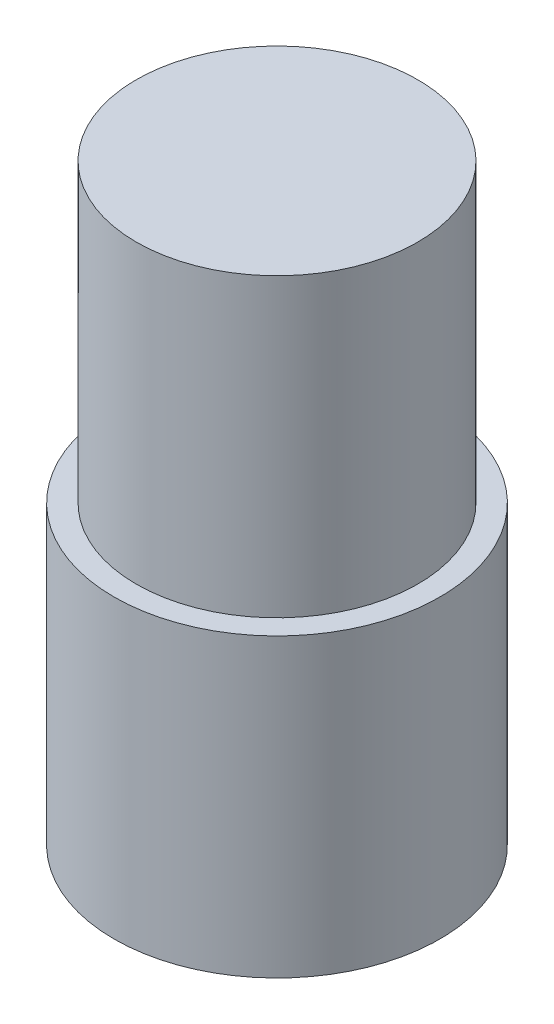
ISO-10303-21;
HEADER;
FILE_DESCRIPTION(('STEP AP214'),'2;1');
FILE_NAME('part.step','',(''),(''),'','','');
FILE_SCHEMA(('AUTOMOTIVE_DESIGN { 1 0 10303 214 1 1 1 1 }'));
ENDSEC;
DATA;
#1=APPLICATION_CONTEXT('core data for automotive mechanical design processes');
#2=APPLICATION_PROTOCOL_DEFINITION('international standard','automotive_design',2000,#1);
#3=PRODUCT_CONTEXT('',#1,'mechanical');
#4=PRODUCT('Part','Part','',(#3));
#5=PRODUCT_RELATED_PRODUCT_CATEGORY('part','',(#4));
#6=PRODUCT_DEFINITION_FORMATION('','',#4);
#7=PRODUCT_DEFINITION_CONTEXT('part definition',#1,'design');
#8=PRODUCT_DEFINITION('design','',#6,#7);
#9=PRODUCT_DEFINITION_SHAPE('','',#8);
#10=(LENGTH_UNIT() NAMED_UNIT(*) SI_UNIT(.MILLI.,.METRE.));
#11=(NAMED_UNIT(*) PLANE_ANGLE_UNIT() SI_UNIT($,.RADIAN.));
#12=(NAMED_UNIT(*) SI_UNIT($,.STERADIAN.) SOLID_ANGLE_UNIT());
#13=UNCERTAINTY_MEASURE_WITH_UNIT(LENGTH_MEASURE(1.E-05),#10,'distance_accuracy_value','');
#14=(GEOMETRIC_REPRESENTATION_CONTEXT(3) GLOBAL_UNCERTAINTY_ASSIGNED_CONTEXT((#13)) GLOBAL_UNIT_ASSIGNED_CONTEXT((#10,
#11,#12)) REPRESENTATION_CONTEXT('',''));
#15=CARTESIAN_POINT('',(0.,0.,0.));
#16=DIRECTION('',(0.,0.,1.));
#17=DIRECTION('',(1.,0.,0.));
#18=AXIS2_PLACEMENT_3D('',#15,#16,#17);
#19=CARTESIAN_POINT('',(0.,5.08,0.));
#20=DIRECTION('',(0.,-1.,0.));
#21=DIRECTION('',(0.,0.,-1.));
#22=AXIS2_PLACEMENT_3D('',#19,#20,#21);
#23=CYLINDRICAL_SURFACE('',#22,1.2065);
#24=CARTESIAN_POINT('',(0.,2.54,0.));
#25=DIRECTION('',(0.,1.,0.));
#26=DIRECTION('',(0.,0.,1.));
#27=AXIS2_PLACEMENT_3D('',#24,#25,#26);
#28=CIRCLE('',#27,1.2065);
#29=CARTESIAN_POINT('',(0.,2.54,1.2065));
#30=VERTEX_POINT('',#29);
#31=EDGE_CURVE('E38',#30,#30,#28,.T.);
#32=ORIENTED_EDGE('',*,*,#31,.T.);
#33=EDGE_LOOP('',(#32));
#34=FACE_BOUND('',#33,.T.);
#35=CARTESIAN_POINT('',(0.,5.08,0.));
#36=DIRECTION('',(0.,1.,0.));
#37=DIRECTION('',(0.,0.,1.));
#38=AXIS2_PLACEMENT_3D('',#35,#36,#37);
#39=CIRCLE('',#38,1.2065);
#40=CARTESIAN_POINT('',(0.,5.08,1.2065));
#41=VERTEX_POINT('',#40);
#42=EDGE_CURVE('E11',#41,#41,#39,.T.);
#43=ORIENTED_EDGE('',*,*,#42,.F.);
#44=EDGE_LOOP('',(#43));
#45=FACE_BOUND('',#44,.T.);
#46=ADVANCED_FACE('F35',(#34,#45),#23,.T.);
#47=CARTESIAN_POINT('',(0.,5.08,0.));
#48=DIRECTION('',(0.,1.,0.));
#49=DIRECTION('',(0.,0.,1.));
#50=AXIS2_PLACEMENT_3D('',#47,#48,#49);
#51=PLANE('',#50);
#52=ORIENTED_EDGE('',*,*,#42,.T.);
#53=EDGE_LOOP('',(#52));
#54=FACE_BOUND('',#53,.T.);
#55=ADVANCED_FACE('F64',(#54),#51,.T.);
#56=CARTESIAN_POINT('',(0.,2.54,0.));
#57=DIRECTION('',(0.,1.,0.));
#58=DIRECTION('',(0.,0.,1.));
#59=AXIS2_PLACEMENT_3D('',#56,#57,#58);
#60=PLANE('',#59);
#61=CARTESIAN_POINT('',(0.,2.54,0.));
#62=DIRECTION('',(0.,1.,0.));
#63=DIRECTION('',(0.,0.,1.));
#64=AXIS2_PLACEMENT_3D('',#61,#62,#63);
#65=CIRCLE('',#64,1.397);
#66=CARTESIAN_POINT('',(0.,2.54,1.397));
#67=VERTEX_POINT('',#66);
#68=EDGE_CURVE('E45',#67,#67,#65,.F.);
#69=ORIENTED_EDGE('',*,*,#68,.F.);
#70=EDGE_LOOP('',(#69));
#71=FACE_BOUND('',#70,.T.);
#72=ORIENTED_EDGE('',*,*,#31,.F.);
#73=EDGE_LOOP('',(#72));
#74=FACE_BOUND('',#73,.T.);
#75=ADVANCED_FACE('F58',(#71,#74),#60,.T.);
#76=CARTESIAN_POINT('',(0.,9.03131269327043,0.));
#77=DIRECTION('',(0.,-1.,0.));
#78=DIRECTION('',(0.,0.,-1.));
#79=AXIS2_PLACEMENT_3D('',#76,#77,#78);
#80=CYLINDRICAL_SURFACE('',#79,1.397);
#81=CARTESIAN_POINT('',(0.,0.,0.));
#82=DIRECTION('',(0.,-1.,0.));
#83=DIRECTION('',(0.,0.,-1.));
#84=AXIS2_PLACEMENT_3D('',#81,#82,#83);
#85=CIRCLE('',#84,1.397);
#86=CARTESIAN_POINT('',(0.,0.,-1.397));
#87=VERTEX_POINT('',#86);
#88=EDGE_CURVE('E49',#87,#87,#85,.T.);
#89=ORIENTED_EDGE('',*,*,#88,.F.);
#90=EDGE_LOOP('',(#89));
#91=FACE_BOUND('',#90,.T.);
#92=ORIENTED_EDGE('',*,*,#68,.T.);
#93=EDGE_LOOP('',(#92));
#94=FACE_BOUND('',#93,.T.);
#95=ADVANCED_FACE('F55',(#91,#94),#80,.T.);
#96=CARTESIAN_POINT('',(0.,0.,0.));
#97=DIRECTION('',(0.,1.,0.));
#98=DIRECTION('',(0.,0.,1.));
#99=AXIS2_PLACEMENT_3D('',#96,#97,#98);
#100=PLANE('',#99);
#101=ORIENTED_EDGE('',*,*,#88,.T.);
#102=EDGE_LOOP('',(#101));
#103=FACE_BOUND('',#102,.T.);
#104=ADVANCED_FACE('F53',(#103),#100,.F.);
#105=CLOSED_SHELL('',(#46,#55,#75,#95,#104));
#106=MANIFOLD_SOLID_BREP('B2',#105);
#107=ADVANCED_BREP_SHAPE_REPRESENTATION('',(#18,#106),#14);
#108=SHAPE_DEFINITION_REPRESENTATION(#9,#107);
ENDSEC;
END-ISO-10303-21;
